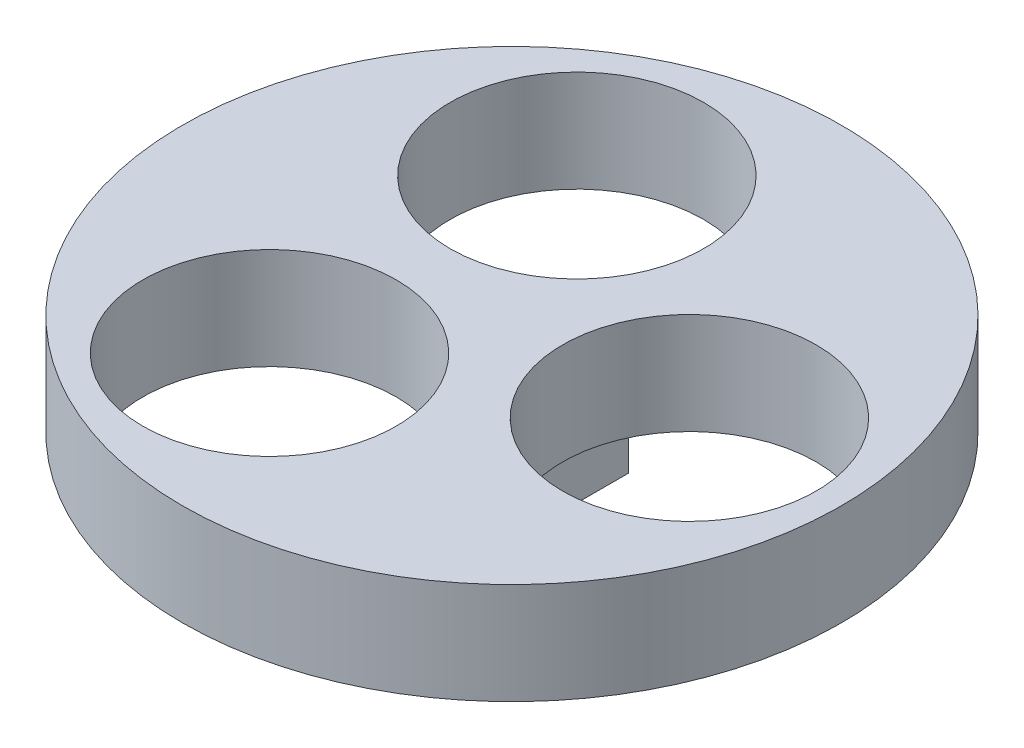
ISO-10303-21;
HEADER;
FILE_DESCRIPTION(('STEP AP214'),'2;1');
FILE_NAME('part.step','',(''),(''),'','','');
FILE_SCHEMA(('AUTOMOTIVE_DESIGN { 1 0 10303 214 1 1 1 1 }'));
ENDSEC;
DATA;
#1=APPLICATION_CONTEXT('core data for automotive mechanical design processes');
#2=APPLICATION_PROTOCOL_DEFINITION('international standard','automotive_design',2000,#1);
#3=PRODUCT_CONTEXT('',#1,'mechanical');
#4=PRODUCT('Part','Part','',(#3));
#5=PRODUCT_RELATED_PRODUCT_CATEGORY('part','',(#4));
#6=PRODUCT_DEFINITION_FORMATION('','',#4);
#7=PRODUCT_DEFINITION_CONTEXT('part definition',#1,'design');
#8=PRODUCT_DEFINITION('design','',#6,#7);
#9=PRODUCT_DEFINITION_SHAPE('','',#8);
#10=(LENGTH_UNIT() NAMED_UNIT(*) SI_UNIT(.MILLI.,.METRE.));
#11=(NAMED_UNIT(*) PLANE_ANGLE_UNIT() SI_UNIT($,.RADIAN.));
#12=(NAMED_UNIT(*) SI_UNIT($,.STERADIAN.) SOLID_ANGLE_UNIT());
#13=UNCERTAINTY_MEASURE_WITH_UNIT(LENGTH_MEASURE(1.E-05),#10,'distance_accuracy_value','');
#14=(GEOMETRIC_REPRESENTATION_CONTEXT(3) GLOBAL_UNCERTAINTY_ASSIGNED_CONTEXT((#13)) GLOBAL_UNIT_ASSIGNED_CONTEXT((#10,
#11,#12)) REPRESENTATION_CONTEXT('',''));
#15=CARTESIAN_POINT('',(0.,0.,0.));
#16=DIRECTION('',(0.,0.,1.));
#17=DIRECTION('',(1.,0.,0.));
#18=AXIS2_PLACEMENT_3D('',#15,#16,#17);
#19=CARTESIAN_POINT('',(0.,2.,0.));
#20=DIRECTION('',(0.,1.,0.));
#21=DIRECTION('',(0.,0.,1.));
#22=AXIS2_PLACEMENT_3D('',#19,#20,#21);
#23=PLANE('',#22);
#24=CARTESIAN_POINT('',(-1.75,2.,3.03108891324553));
#25=DIRECTION('',(0.,1.,0.));
#26=DIRECTION('',(0.,0.,1.));
#27=AXIS2_PLACEMENT_3D('',#24,#25,#26);
#28=CIRCLE('',#27,2.5);
#29=CARTESIAN_POINT('',(-1.75,2.,5.53108891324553));
#30=VERTEX_POINT('',#29);
#31=EDGE_CURVE('E97',#30,#30,#28,.T.);
#32=ORIENTED_EDGE('',*,*,#31,.F.);
#33=EDGE_LOOP('',(#32));
#34=FACE_BOUND('',#33,.T.);
#35=CARTESIAN_POINT('',(0.,2.,0.));
#36=DIRECTION('',(0.,1.,0.));
#37=DIRECTION('',(0.,0.,1.));
#38=AXIS2_PLACEMENT_3D('',#35,#36,#37);
#39=CIRCLE('',#38,6.5);
#40=CARTESIAN_POINT('',(0.,2.,6.5));
#41=VERTEX_POINT('',#40);
#42=EDGE_CURVE('E11',#41,#41,#39,.T.);
#43=ORIENTED_EDGE('',*,*,#42,.T.);
#44=EDGE_LOOP('',(#43));
#45=FACE_BOUND('',#44,.T.);
#46=CARTESIAN_POINT('',(3.5,2.,0.));
#47=DIRECTION('',(0.,1.,0.));
#48=DIRECTION('',(0.,0.,1.));
#49=AXIS2_PLACEMENT_3D('',#46,#47,#48);
#50=CIRCLE('',#49,2.5);
#51=CARTESIAN_POINT('',(3.5,2.,2.5));
#52=VERTEX_POINT('',#51);
#53=EDGE_CURVE('E103',#52,#52,#50,.T.);
#54=ORIENTED_EDGE('',*,*,#53,.F.);
#55=EDGE_LOOP('',(#54));
#56=FACE_BOUND('',#55,.T.);
#57=CARTESIAN_POINT('',(-1.75,2.,-3.03108891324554));
#58=DIRECTION('',(0.,1.,0.));
#59=DIRECTION('',(0.,0.,1.));
#60=AXIS2_PLACEMENT_3D('',#57,#58,#59);
#61=CIRCLE('',#60,2.5);
#62=CARTESIAN_POINT('',(-1.75,2.,-0.531088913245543));
#63=VERTEX_POINT('',#62);
#64=EDGE_CURVE('E91',#63,#63,#61,.T.);
#65=ORIENTED_EDGE('',*,*,#64,.F.);
#66=EDGE_LOOP('',(#65));
#67=FACE_BOUND('',#66,.T.);
#68=ADVANCED_FACE('F26',(#34,#45,#56,#67),#23,.T.);
#69=CARTESIAN_POINT('',(0.,0.,0.));
#70=DIRECTION('',(0.,1.,0.));
#71=DIRECTION('',(0.,0.,1.));
#72=AXIS2_PLACEMENT_3D('',#69,#70,#71);
#73=PLANE('',#72);
#74=DIRECTION('',(0.,0.,-1.));
#75=VECTOR('',#74,1.);
#76=CARTESIAN_POINT('',(0.84294945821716,0.,-1.46003128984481));
#77=LINE('',#76,#75);
#78=CARTESIAN_POINT('',(0.84294945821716,0.,1.46003128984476));
#79=VERTEX_POINT('',#78);
#80=CARTESIAN_POINT('',(0.84294945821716,0.,-1.46003128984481));
#81=VERTEX_POINT('',#80);
#82=EDGE_CURVE('E41',#79,#81,#77,.T.);
#83=ORIENTED_EDGE('',*,*,#82,.T.);
#84=DIRECTION('',(-0.866025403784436,0.,0.500000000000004));
#85=VECTOR('',#84,1.);
#86=CARTESIAN_POINT('',(-1.68589891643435,0.,0.));
#87=LINE('',#86,#85);
#88=CARTESIAN_POINT('',(-1.68589891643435,0.,0.));
#89=VERTEX_POINT('',#88);
#90=EDGE_CURVE('E63',#81,#89,#87,.T.);
#91=ORIENTED_EDGE('',*,*,#90,.T.);
#92=DIRECTION('',(0.866025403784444,0.,0.499999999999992));
#93=VECTOR('',#92,1.);
#94=CARTESIAN_POINT('',(0.84294945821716,0.,1.46003128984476));
#95=LINE('',#94,#93);
#96=EDGE_CURVE('E72',#89,#79,#95,.T.);
#97=ORIENTED_EDGE('',*,*,#96,.T.);
#98=EDGE_LOOP('',(#83,#91,#97));
#99=FACE_BOUND('',#98,.T.);
#100=CARTESIAN_POINT('',(-1.75,0.,3.03108891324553));
#101=DIRECTION('',(0.,1.,0.));
#102=DIRECTION('',(0.,0.,1.));
#103=AXIS2_PLACEMENT_3D('',#100,#101,#102);
#104=CIRCLE('',#103,2.5);
#105=CARTESIAN_POINT('',(-1.75,0.,5.53108891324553));
#106=VERTEX_POINT('',#105);
#107=EDGE_CURVE('E94',#106,#106,#104,.T.);
#108=ORIENTED_EDGE('',*,*,#107,.T.);
#109=EDGE_LOOP('',(#108));
#110=FACE_BOUND('',#109,.T.);
#111=CARTESIAN_POINT('',(0.,0.,0.));
#112=DIRECTION('',(0.,1.,0.));
#113=DIRECTION('',(0.,0.,1.));
#114=AXIS2_PLACEMENT_3D('',#111,#112,#113);
#115=CIRCLE('',#114,6.5);
#116=CARTESIAN_POINT('',(0.,0.,6.5));
#117=VERTEX_POINT('',#116);
#118=EDGE_CURVE('E34',#117,#117,#115,.T.);
#119=ORIENTED_EDGE('',*,*,#118,.F.);
#120=EDGE_LOOP('',(#119));
#121=FACE_BOUND('',#120,.T.);
#122=CARTESIAN_POINT('',(3.5,0.,0.));
#123=DIRECTION('',(0.,1.,0.));
#124=DIRECTION('',(0.,0.,1.));
#125=AXIS2_PLACEMENT_3D('',#122,#123,#124);
#126=CIRCLE('',#125,2.5);
#127=CARTESIAN_POINT('',(3.5,0.,2.5));
#128=VERTEX_POINT('',#127);
#129=EDGE_CURVE('E100',#128,#128,#126,.T.);
#130=ORIENTED_EDGE('',*,*,#129,.T.);
#131=EDGE_LOOP('',(#130));
#132=FACE_BOUND('',#131,.T.);
#133=CARTESIAN_POINT('',(-1.75,0.,-3.03108891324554));
#134=DIRECTION('',(0.,1.,0.));
#135=DIRECTION('',(0.,0.,1.));
#136=AXIS2_PLACEMENT_3D('',#133,#134,#135);
#137=CIRCLE('',#136,2.5);
#138=CARTESIAN_POINT('',(-1.75,0.,-0.531088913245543));
#139=VERTEX_POINT('',#138);
#140=EDGE_CURVE('E87',#139,#139,#137,.T.);
#141=ORIENTED_EDGE('',*,*,#140,.T.);
#142=EDGE_LOOP('',(#141));
#143=FACE_BOUND('',#142,.T.);
#144=ADVANCED_FACE('F76',(#99,#110,#121,#132,#143),#73,.F.);
#145=CARTESIAN_POINT('',(0.,2.,0.));
#146=DIRECTION('',(0.,-1.,0.));
#147=DIRECTION('',(0.,0.,-1.));
#148=AXIS2_PLACEMENT_3D('',#145,#146,#147);
#149=CYLINDRICAL_SURFACE('',#148,6.5);
#150=ORIENTED_EDGE('',*,*,#42,.F.);
#151=EDGE_LOOP('',(#150));
#152=FACE_BOUND('',#151,.T.);
#153=ORIENTED_EDGE('',*,*,#118,.T.);
#154=EDGE_LOOP('',(#153));
#155=FACE_BOUND('',#154,.T.);
#156=ADVANCED_FACE('F28',(#152,#155),#149,.T.);
#157=CARTESIAN_POINT('',(3.5,2.,0.));
#158=DIRECTION('',(0.,-1.,0.));
#159=DIRECTION('',(0.,0.,-1.));
#160=AXIS2_PLACEMENT_3D('',#157,#158,#159);
#161=CYLINDRICAL_SURFACE('',#160,2.5);
#162=ORIENTED_EDGE('',*,*,#53,.T.);
#163=EDGE_LOOP('',(#162));
#164=FACE_BOUND('',#163,.T.);
#165=ORIENTED_EDGE('',*,*,#129,.F.);
#166=EDGE_LOOP('',(#165));
#167=FACE_BOUND('',#166,.T.);
#168=ADVANCED_FACE('F127',(#164,#167),#161,.F.);
#169=CARTESIAN_POINT('',(-1.75,2.,3.03108891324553));
#170=DIRECTION('',(0.,-1.,0.));
#171=DIRECTION('',(0.,0.,-1.));
#172=AXIS2_PLACEMENT_3D('',#169,#170,#171);
#173=CYLINDRICAL_SURFACE('',#172,2.5);
#174=ORIENTED_EDGE('',*,*,#31,.T.);
#175=EDGE_LOOP('',(#174));
#176=FACE_BOUND('',#175,.T.);
#177=ORIENTED_EDGE('',*,*,#107,.F.);
#178=EDGE_LOOP('',(#177));
#179=FACE_BOUND('',#178,.T.);
#180=ADVANCED_FACE('F118',(#176,#179),#173,.F.);
#181=CARTESIAN_POINT('',(-1.75,2.,-3.03108891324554));
#182=DIRECTION('',(0.,-1.,0.));
#183=DIRECTION('',(0.,0.,-1.));
#184=AXIS2_PLACEMENT_3D('',#181,#182,#183);
#185=CYLINDRICAL_SURFACE('',#184,2.5);
#186=ORIENTED_EDGE('',*,*,#64,.T.);
#187=EDGE_LOOP('',(#186));
#188=FACE_BOUND('',#187,.T.);
#189=ORIENTED_EDGE('',*,*,#140,.F.);
#190=EDGE_LOOP('',(#189));
#191=FACE_BOUND('',#190,.T.);
#192=ADVANCED_FACE('F116',(#188,#191),#185,.F.);
#193=CARTESIAN_POINT('',(-1.68589891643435,-1.,0.));
#194=DIRECTION('',(-0.500000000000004,0.,-0.866025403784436));
#195=DIRECTION('',(-0.866025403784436,0.,0.500000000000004));
#196=AXIS2_PLACEMENT_3D('',#193,#194,#195);
#197=PLANE('',#196);
#198=ORIENTED_EDGE('',*,*,#90,.F.);
#199=DIRECTION('',(0.,1.,0.));
#200=VECTOR('',#199,1.);
#201=CARTESIAN_POINT('',(0.84294945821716,-1.,-1.46003128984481));
#202=LINE('',#201,#200);
#203=CARTESIAN_POINT('',(0.84294945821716,-1.,-1.46003128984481));
#204=VERTEX_POINT('',#203);
#205=EDGE_CURVE('E48',#204,#81,#202,.T.);
#206=ORIENTED_EDGE('',*,*,#205,.F.);
#207=DIRECTION('',(-0.866025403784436,0.,0.500000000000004));
#208=VECTOR('',#207,1.);
#209=CARTESIAN_POINT('',(-1.68589891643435,-1.,0.));
#210=LINE('',#209,#208);
#211=CARTESIAN_POINT('',(-1.68589891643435,-1.,0.));
#212=VERTEX_POINT('',#211);
#213=EDGE_CURVE('E64',#204,#212,#210,.T.);
#214=ORIENTED_EDGE('',*,*,#213,.T.);
#215=DIRECTION('',(0.,1.,0.));
#216=VECTOR('',#215,1.);
#217=CARTESIAN_POINT('',(-1.68589891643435,-1.,0.));
#218=LINE('',#217,#216);
#219=EDGE_CURVE('E59',#212,#89,#218,.T.);
#220=ORIENTED_EDGE('',*,*,#219,.T.);
#221=EDGE_LOOP('',(#198,#206,#214,#220));
#222=FACE_BOUND('',#221,.T.);
#223=ADVANCED_FACE('F61',(#222),#197,.T.);
#224=CARTESIAN_POINT('',(0.84294945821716,-1.,-1.46003128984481));
#225=DIRECTION('',(1.,0.,0.));
#226=DIRECTION('',(0.,0.,-1.));
#227=AXIS2_PLACEMENT_3D('',#224,#225,#226);
#228=PLANE('',#227);
#229=ORIENTED_EDGE('',*,*,#82,.F.);
#230=DIRECTION('',(0.,1.,0.));
#231=VECTOR('',#230,1.);
#232=CARTESIAN_POINT('',(0.84294945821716,-1.,1.46003128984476));
#233=LINE('',#232,#231);
#234=CARTESIAN_POINT('',(0.84294945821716,-1.,1.46003128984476));
#235=VERTEX_POINT('',#234);
#236=EDGE_CURVE('E68',#235,#79,#233,.T.);
#237=ORIENTED_EDGE('',*,*,#236,.F.);
#238=DIRECTION('',(0.,0.,-1.));
#239=VECTOR('',#238,1.);
#240=CARTESIAN_POINT('',(0.84294945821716,-1.,-1.46003128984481));
#241=LINE('',#240,#239);
#242=EDGE_CURVE('E69',#235,#204,#241,.T.);
#243=ORIENTED_EDGE('',*,*,#242,.T.);
#244=ORIENTED_EDGE('',*,*,#205,.T.);
#245=EDGE_LOOP('',(#229,#237,#243,#244));
#246=FACE_BOUND('',#245,.T.);
#247=ADVANCED_FACE('F125',(#246),#228,.T.);
#248=CARTESIAN_POINT('',(0.84294945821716,-1.,1.46003128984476));
#249=DIRECTION('',(-0.499999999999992,0.,0.866025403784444));
#250=DIRECTION('',(0.866025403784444,0.,0.499999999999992));
#251=AXIS2_PLACEMENT_3D('',#248,#249,#250);
#252=PLANE('',#251);
#253=ORIENTED_EDGE('',*,*,#96,.F.);
#254=ORIENTED_EDGE('',*,*,#219,.F.);
#255=DIRECTION('',(0.866025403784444,0.,0.499999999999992));
#256=VECTOR('',#255,1.);
#257=CARTESIAN_POINT('',(0.84294945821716,-1.,1.46003128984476));
#258=LINE('',#257,#256);
#259=EDGE_CURVE('E82',#212,#235,#258,.T.);
#260=ORIENTED_EDGE('',*,*,#259,.T.);
#261=ORIENTED_EDGE('',*,*,#236,.T.);
#262=EDGE_LOOP('',(#253,#254,#260,#261));
#263=FACE_BOUND('',#262,.T.);
#264=ADVANCED_FACE('F73',(#263),#252,.T.);
#265=CARTESIAN_POINT('',(0.84294945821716,-1.,-1.46003128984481));
#266=DIRECTION('',(0.,-1.,0.));
#267=DIRECTION('',(0.,0.,-1.));
#268=AXIS2_PLACEMENT_3D('',#265,#266,#267);
#269=PLANE('',#268);
#270=ORIENTED_EDGE('',*,*,#213,.F.);
#271=ORIENTED_EDGE('',*,*,#242,.F.);
#272=ORIENTED_EDGE('',*,*,#259,.F.);
#273=EDGE_LOOP('',(#270,#271,#272));
#274=FACE_BOUND('',#273,.T.);
#275=ADVANCED_FACE('F179',(#274),#269,.T.);
#276=CLOSED_SHELL('',(#68,#144,#156,#168,#180,#192,#223,#247,#264,#275));
#277=MANIFOLD_SOLID_BREP('B2',#276);
#278=ADVANCED_BREP_SHAPE_REPRESENTATION('',(#18,#277),#14);
#279=SHAPE_DEFINITION_REPRESENTATION(#9,#278);
ENDSEC;
END-ISO-10303-21;
